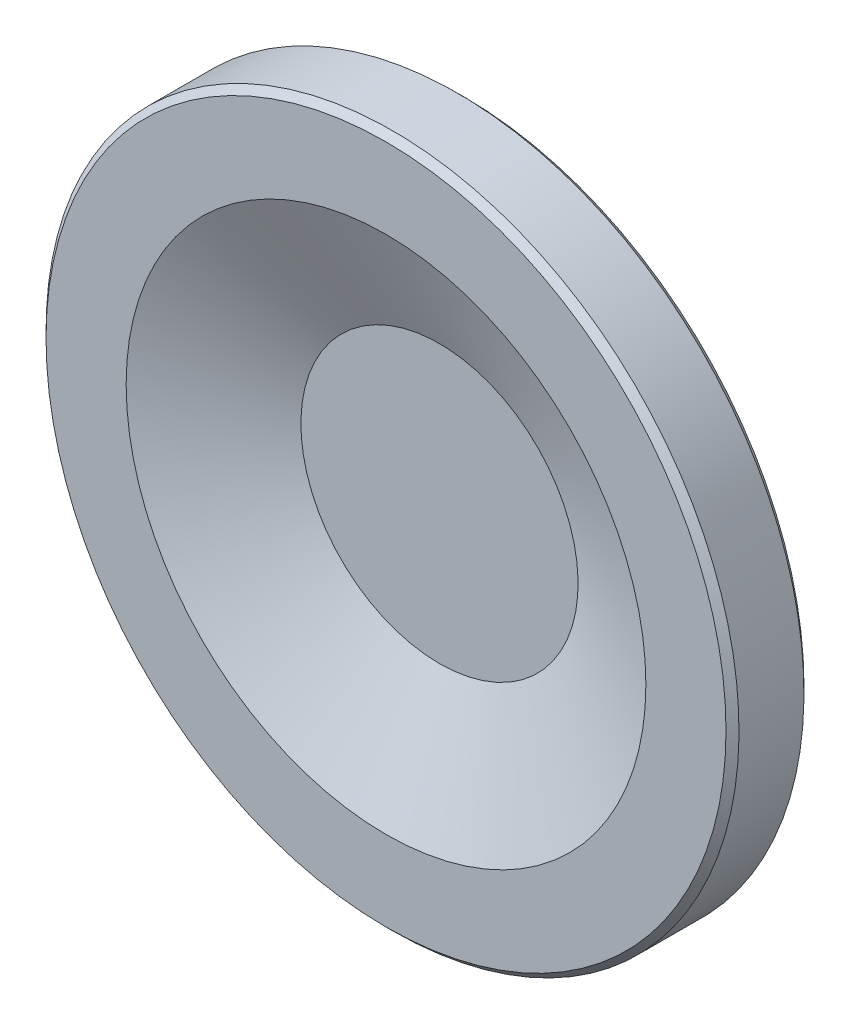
ISO-10303-21;
HEADER;
FILE_DESCRIPTION(('STEP AP214'),'2;1');
FILE_NAME('part.step','',(''),(''),'','','');
FILE_SCHEMA(('AUTOMOTIVE_DESIGN { 1 0 10303 214 1 1 1 1 }'));
ENDSEC;
DATA;
#1=APPLICATION_CONTEXT('core data for automotive mechanical design processes');
#2=APPLICATION_PROTOCOL_DEFINITION('international standard','automotive_design',2000,#1);
#3=PRODUCT_CONTEXT('',#1,'mechanical');
#4=PRODUCT('Part','Part','',(#3));
#5=PRODUCT_RELATED_PRODUCT_CATEGORY('part','',(#4));
#6=PRODUCT_DEFINITION_FORMATION('','',#4);
#7=PRODUCT_DEFINITION_CONTEXT('part definition',#1,'design');
#8=PRODUCT_DEFINITION('design','',#6,#7);
#9=PRODUCT_DEFINITION_SHAPE('','',#8);
#10=(LENGTH_UNIT() NAMED_UNIT(*) SI_UNIT(.MILLI.,.METRE.));
#11=(NAMED_UNIT(*) PLANE_ANGLE_UNIT() SI_UNIT($,.RADIAN.));
#12=(NAMED_UNIT(*) SI_UNIT($,.STERADIAN.) SOLID_ANGLE_UNIT());
#13=UNCERTAINTY_MEASURE_WITH_UNIT(LENGTH_MEASURE(1.E-05),#10,'distance_accuracy_value','');
#14=(GEOMETRIC_REPRESENTATION_CONTEXT(3) GLOBAL_UNCERTAINTY_ASSIGNED_CONTEXT((#13)) GLOBAL_UNIT_ASSIGNED_CONTEXT((#10,
#11,#12)) REPRESENTATION_CONTEXT('',''));
#15=CARTESIAN_POINT('',(0.,0.,0.));
#16=DIRECTION('',(0.,0.,1.));
#17=DIRECTION('',(1.,0.,0.));
#18=AXIS2_PLACEMENT_3D('',#15,#16,#17);
#19=CARTESIAN_POINT('',(0.,0.,50.5));
#20=DIRECTION('',(0.,0.,-1.));
#21=DIRECTION('',(0.,1.,0.));
#22=AXIS2_PLACEMENT_3D('',#19,#20,#21);
#23=CONICAL_SURFACE('',#22,80.,0.785398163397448);
#24=CARTESIAN_POINT('',(0.,0.,52.));
#25=DIRECTION('',(0.,0.,1.));
#26=DIRECTION('',(0.,-1.,0.));
#27=AXIS2_PLACEMENT_3D('',#24,#25,#26);
#28=CIRCLE('',#27,78.5);
#29=CARTESIAN_POINT('',(0.,-78.5,51.9999999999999));
#30=VERTEX_POINT('',#29);
#31=EDGE_CURVE('E8',#30,#30,#28,.T.);
#32=ORIENTED_EDGE('',*,*,#31,.F.);
#33=EDGE_LOOP('',(#32));
#34=FACE_BOUND('',#33,.T.);
#35=CARTESIAN_POINT('',(0.,0.,50.5));
#36=DIRECTION('',(0.,0.,1.));
#37=DIRECTION('',(0.,-1.,0.));
#38=AXIS2_PLACEMENT_3D('',#35,#36,#37);
#39=CIRCLE('',#38,80.);
#40=CARTESIAN_POINT('',(0.,-80.,50.4999999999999));
#41=VERTEX_POINT('',#40);
#42=EDGE_CURVE('E55',#41,#41,#39,.T.);
#43=ORIENTED_EDGE('',*,*,#42,.T.);
#44=EDGE_LOOP('',(#43));
#45=FACE_BOUND('',#44,.T.);
#46=ADVANCED_FACE('F12',(#34,#45),#23,.T.);
#47=CARTESIAN_POINT('',(0.,60.,52.));
#48=DIRECTION('',(0.,0.,1.));
#49=DIRECTION('',(0.,-1.,0.));
#50=AXIS2_PLACEMENT_3D('',#47,#48,#49);
#51=PLANE('',#50);
#52=ORIENTED_EDGE('',*,*,#31,.T.);
#53=EDGE_LOOP('',(#52));
#54=FACE_BOUND('',#53,.T.);
#55=CARTESIAN_POINT('',(0.,0.,52.));
#56=DIRECTION('',(0.,0.,1.));
#57=DIRECTION('',(0.,-1.,0.));
#58=AXIS2_PLACEMENT_3D('',#55,#56,#57);
#59=CIRCLE('',#58,60.);
#60=CARTESIAN_POINT('',(0.,-60.,52.));
#61=VERTEX_POINT('',#60);
#62=EDGE_CURVE('E18',#61,#61,#59,.T.);
#63=ORIENTED_EDGE('',*,*,#62,.F.);
#64=EDGE_LOOP('',(#63));
#65=FACE_BOUND('',#64,.T.);
#66=ADVANCED_FACE('F74',(#54,#65),#51,.T.);
#67=CARTESIAN_POINT('',(0.,0.,39.6561679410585));
#68=DIRECTION('',(0.,0.,1.));
#69=DIRECTION('',(0.,-1.,0.));
#70=AXIS2_PLACEMENT_3D('',#67,#68,#69);
#71=CONICAL_SURFACE('',#70,32.,1.15557658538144);
#72=ORIENTED_EDGE('',*,*,#62,.T.);
#73=EDGE_LOOP('',(#72));
#74=FACE_BOUND('',#73,.T.);
#75=CARTESIAN_POINT('',(0.,0.,39.6561679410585));
#76=DIRECTION('',(0.,0.,1.));
#77=DIRECTION('',(0.,-1.,0.));
#78=AXIS2_PLACEMENT_3D('',#75,#76,#77);
#79=CIRCLE('',#78,32.);
#80=CARTESIAN_POINT('',(0.,-32.,39.6561679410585));
#81=VERTEX_POINT('',#80);
#82=EDGE_CURVE('E22',#81,#81,#79,.T.);
#83=ORIENTED_EDGE('',*,*,#82,.F.);
#84=EDGE_LOOP('',(#83));
#85=FACE_BOUND('',#84,.T.);
#86=ADVANCED_FACE('F80',(#74,#85),#71,.F.);
#87=CARTESIAN_POINT('',(0.,0.,39.6561679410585));
#88=DIRECTION('',(0.,0.,1.));
#89=DIRECTION('',(0.,-1.,0.));
#90=AXIS2_PLACEMENT_3D('',#87,#88,#89);
#91=PLANE('',#90);
#92=ORIENTED_EDGE('',*,*,#82,.T.);
#93=EDGE_LOOP('',(#92));
#94=FACE_BOUND('',#93,.T.);
#95=ADVANCED_FACE('F85',(#94),#91,.T.);
#96=CARTESIAN_POINT('',(0.,16.,0.));
#97=DIRECTION('',(0.,0.,-1.));
#98=DIRECTION('',(0.,1.,0.));
#99=AXIS2_PLACEMENT_3D('',#96,#97,#98);
#100=PLANE('',#99);
#101=CARTESIAN_POINT('',(0.,0.,0.));
#102=DIRECTION('',(0.,0.,1.));
#103=DIRECTION('',(0.,-1.,0.));
#104=AXIS2_PLACEMENT_3D('',#101,#102,#103);
#105=CIRCLE('',#104,16.);
#106=CARTESIAN_POINT('',(0.,-16.,0.));
#107=VERTEX_POINT('',#106);
#108=EDGE_CURVE('E26',#107,#107,#105,.T.);
#109=ORIENTED_EDGE('',*,*,#108,.F.);
#110=EDGE_LOOP('',(#109));
#111=FACE_BOUND('',#110,.T.);
#112=ADVANCED_FACE('F91',(#111),#100,.T.);
#113=CARTESIAN_POINT('',(0.,0.,0.));
#114=DIRECTION('',(0.,0.,1.));
#115=DIRECTION('',(0.,-1.,0.));
#116=AXIS2_PLACEMENT_3D('',#113,#114,#115);
#117=CONICAL_SURFACE('',#116,16.,0.785398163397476);
#118=CARTESIAN_POINT('',(0.,0.,1.));
#119=DIRECTION('',(0.,0.,1.));
#120=DIRECTION('',(0.,-1.,0.));
#121=AXIS2_PLACEMENT_3D('',#118,#119,#120);
#122=CIRCLE('',#121,17.);
#123=CARTESIAN_POINT('',(0.,-17.,0.999999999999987));
#124=VERTEX_POINT('',#123);
#125=EDGE_CURVE('E31',#124,#124,#122,.T.);
#126=ORIENTED_EDGE('',*,*,#125,.F.);
#127=EDGE_LOOP('',(#126));
#128=FACE_BOUND('',#127,.T.);
#129=ORIENTED_EDGE('',*,*,#108,.T.);
#130=EDGE_LOOP('',(#129));
#131=FACE_BOUND('',#130,.T.);
#132=ADVANCED_FACE('F95',(#128,#131),#117,.T.);
#133=CARTESIAN_POINT('',(0.,0.,62.));
#134=DIRECTION('',(0.,0.,1.));
#135=DIRECTION('',(0.,-1.,0.));
#136=AXIS2_PLACEMENT_3D('',#133,#134,#135);
#137=CYLINDRICAL_SURFACE('',#136,17.);
#138=ORIENTED_EDGE('',*,*,#125,.T.);
#139=EDGE_LOOP('',(#138));
#140=FACE_BOUND('',#139,.T.);
#141=CARTESIAN_POINT('',(0.,0.,16.));
#142=DIRECTION('',(0.,0.,1.));
#143=DIRECTION('',(0.,-1.,0.));
#144=AXIS2_PLACEMENT_3D('',#141,#142,#143);
#145=CIRCLE('',#144,17.);
#146=CARTESIAN_POINT('',(0.,-17.,16.));
#147=VERTEX_POINT('',#146);
#148=EDGE_CURVE('E34',#147,#147,#145,.T.);
#149=ORIENTED_EDGE('',*,*,#148,.F.);
#150=EDGE_LOOP('',(#149));
#151=FACE_BOUND('',#150,.T.);
#152=ADVANCED_FACE('F99',(#140,#151),#137,.T.);
#153=CARTESIAN_POINT('',(0.,21.5,16.));
#154=DIRECTION('',(0.,0.,-1.));
#155=DIRECTION('',(0.,1.,0.));
#156=AXIS2_PLACEMENT_3D('',#153,#154,#155);
#157=PLANE('',#156);
#158=ORIENTED_EDGE('',*,*,#148,.T.);
#159=EDGE_LOOP('',(#158));
#160=FACE_BOUND('',#159,.T.);
#161=CARTESIAN_POINT('',(0.,0.,16.));
#162=DIRECTION('',(0.,0.,1.));
#163=DIRECTION('',(0.,-1.,0.));
#164=AXIS2_PLACEMENT_3D('',#161,#162,#163);
#165=CIRCLE('',#164,21.5);
#166=CARTESIAN_POINT('',(0.,-21.5,16.));
#167=VERTEX_POINT('',#166);
#168=EDGE_CURVE('E37',#167,#167,#165,.T.);
#169=ORIENTED_EDGE('',*,*,#168,.F.);
#170=EDGE_LOOP('',(#169));
#171=FACE_BOUND('',#170,.T.);
#172=ADVANCED_FACE('F103',(#160,#171),#157,.T.);
#173=CARTESIAN_POINT('',(0.,0.,62.));
#174=DIRECTION('',(0.,0.,1.));
#175=DIRECTION('',(0.,-1.,0.));
#176=AXIS2_PLACEMENT_3D('',#173,#174,#175);
#177=CYLINDRICAL_SURFACE('',#176,21.5);
#178=CARTESIAN_POINT('',(0.,0.,20.848797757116));
#179=DIRECTION('',(0.,0.,1.));
#180=DIRECTION('',(0.,-1.,0.));
#181=AXIS2_PLACEMENT_3D('',#178,#179,#180);
#182=CIRCLE('',#181,21.5);
#183=CARTESIAN_POINT('',(0.,-21.5,20.848797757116));
#184=VERTEX_POINT('',#183);
#185=EDGE_CURVE('E40',#184,#184,#182,.T.);
#186=ORIENTED_EDGE('',*,*,#185,.F.);
#187=EDGE_LOOP('',(#186));
#188=FACE_BOUND('',#187,.T.);
#189=ORIENTED_EDGE('',*,*,#168,.T.);
#190=EDGE_LOOP('',(#189));
#191=FACE_BOUND('',#190,.T.);
#192=ADVANCED_FACE('F107',(#188,#191),#177,.T.);
#193=CARTESIAN_POINT('',(0.,0.,20.848797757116));
#194=DIRECTION('',(0.,0.,1.));
#195=DIRECTION('',(0.,-1.,0.));
#196=AXIS2_PLACEMENT_3D('',#193,#194,#195);
#197=TOROIDAL_SURFACE('',#196,26.5,5.);
#198=ORIENTED_EDGE('',*,*,#185,.T.);
#199=EDGE_LOOP('',(#198));
#200=FACE_BOUND('',#199,.T.);
#201=CARTESIAN_POINT('',(0.,0.,25.2848817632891));
#202=DIRECTION('',(0.,0.,1.));
#203=DIRECTION('',(0.,-1.,0.));
#204=AXIS2_PLACEMENT_3D('',#201,#202,#203);
#205=CIRCLE('',#204,24.1932363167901);
#206=CARTESIAN_POINT('',(0.,-24.1932363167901,25.284881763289));
#207=VERTEX_POINT('',#206);
#208=EDGE_CURVE('E43',#207,#207,#205,.T.);
#209=ORIENTED_EDGE('',*,*,#208,.F.);
#210=EDGE_LOOP('',(#209));
#211=FACE_BOUND('',#210,.T.);
#212=ADVANCED_FACE('F111',(#200,#211),#197,.F.);
#213=CARTESIAN_POINT('',(0.,0.,25.2848817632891));
#214=DIRECTION('',(0.,0.,1.));
#215=DIRECTION('',(0.,-1.,0.));
#216=AXIS2_PLACEMENT_3D('',#213,#214,#215);
#217=CONICAL_SURFACE('',#216,24.1932363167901,1.09127703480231);
#218=CARTESIAN_POINT('',(0.,0.,34.));
#219=DIRECTION('',(0.,0.,1.));
#220=DIRECTION('',(0.,-1.,0.));
#221=AXIS2_PLACEMENT_3D('',#218,#219,#220);
#222=CIRCLE('',#221,40.9530790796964);
#223=CARTESIAN_POINT('',(0.,-40.9530790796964,34.));
#224=VERTEX_POINT('',#223);
#225=EDGE_CURVE('E46',#224,#224,#222,.T.);
#226=ORIENTED_EDGE('',*,*,#225,.F.);
#227=EDGE_LOOP('',(#226));
#228=FACE_BOUND('',#227,.T.);
#229=ORIENTED_EDGE('',*,*,#208,.T.);
#230=EDGE_LOOP('',(#229));
#231=FACE_BOUND('',#230,.T.);
#232=ADVANCED_FACE('F115',(#228,#231),#217,.T.);
#233=CARTESIAN_POINT('',(0.,40.9530790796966,34.));
#234=DIRECTION('',(0.,0.,1.));
#235=DIRECTION('',(0.,-1.,0.));
#236=AXIS2_PLACEMENT_3D('',#233,#234,#235);
#237=PLANE('',#236);
#238=CARTESIAN_POINT('',(0.,0.,34.));
#239=DIRECTION('',(0.,0.,1.));
#240=DIRECTION('',(0.,-1.,0.));
#241=AXIS2_PLACEMENT_3D('',#238,#239,#240);
#242=CIRCLE('',#241,78.5);
#243=CARTESIAN_POINT('',(0.,-78.5,33.9999999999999));
#244=VERTEX_POINT('',#243);
#245=EDGE_CURVE('E49',#244,#244,#242,.T.);
#246=ORIENTED_EDGE('',*,*,#245,.F.);
#247=EDGE_LOOP('',(#246));
#248=FACE_BOUND('',#247,.T.);
#249=ORIENTED_EDGE('',*,*,#225,.T.);
#250=EDGE_LOOP('',(#249));
#251=FACE_BOUND('',#250,.T.);
#252=ADVANCED_FACE('F70',(#248,#251),#237,.F.);
#253=CARTESIAN_POINT('',(0.,0.,35.5));
#254=DIRECTION('',(0.,0.,1.));
#255=DIRECTION('',(0.,-1.,0.));
#256=AXIS2_PLACEMENT_3D('',#253,#254,#255);
#257=CONICAL_SURFACE('',#256,80.,0.785398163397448);
#258=ORIENTED_EDGE('',*,*,#245,.T.);
#259=EDGE_LOOP('',(#258));
#260=FACE_BOUND('',#259,.T.);
#261=CARTESIAN_POINT('',(0.,0.,35.5));
#262=DIRECTION('',(0.,0.,1.));
#263=DIRECTION('',(0.,-1.,0.));
#264=AXIS2_PLACEMENT_3D('',#261,#262,#263);
#265=CIRCLE('',#264,80.);
#266=CARTESIAN_POINT('',(0.,-80.,35.4999999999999));
#267=VERTEX_POINT('',#266);
#268=EDGE_CURVE('E52',#267,#267,#265,.T.);
#269=ORIENTED_EDGE('',*,*,#268,.F.);
#270=EDGE_LOOP('',(#269));
#271=FACE_BOUND('',#270,.T.);
#272=ADVANCED_FACE('F62',(#260,#271),#257,.T.);
#273=CARTESIAN_POINT('',(0.,0.,62.));
#274=DIRECTION('',(0.,0.,1.));
#275=DIRECTION('',(0.,-1.,0.));
#276=AXIS2_PLACEMENT_3D('',#273,#274,#275);
#277=CYLINDRICAL_SURFACE('',#276,80.);
#278=ORIENTED_EDGE('',*,*,#268,.T.);
#279=EDGE_LOOP('',(#278));
#280=FACE_BOUND('',#279,.T.);
#281=ORIENTED_EDGE('',*,*,#42,.F.);
#282=EDGE_LOOP('',(#281));
#283=FACE_BOUND('',#282,.T.);
#284=ADVANCED_FACE('F60',(#280,#283),#277,.T.);
#285=CLOSED_SHELL('',(#46,#66,#86,#95,#112,#132,#152,#172,#192,#212,#232,#252,#272,#284));
#286=MANIFOLD_SOLID_BREP('B1',#285);
#287=ADVANCED_BREP_SHAPE_REPRESENTATION('',(#18,#286),#14);
#288=SHAPE_DEFINITION_REPRESENTATION(#9,#287);
ENDSEC;
END-ISO-10303-21;
